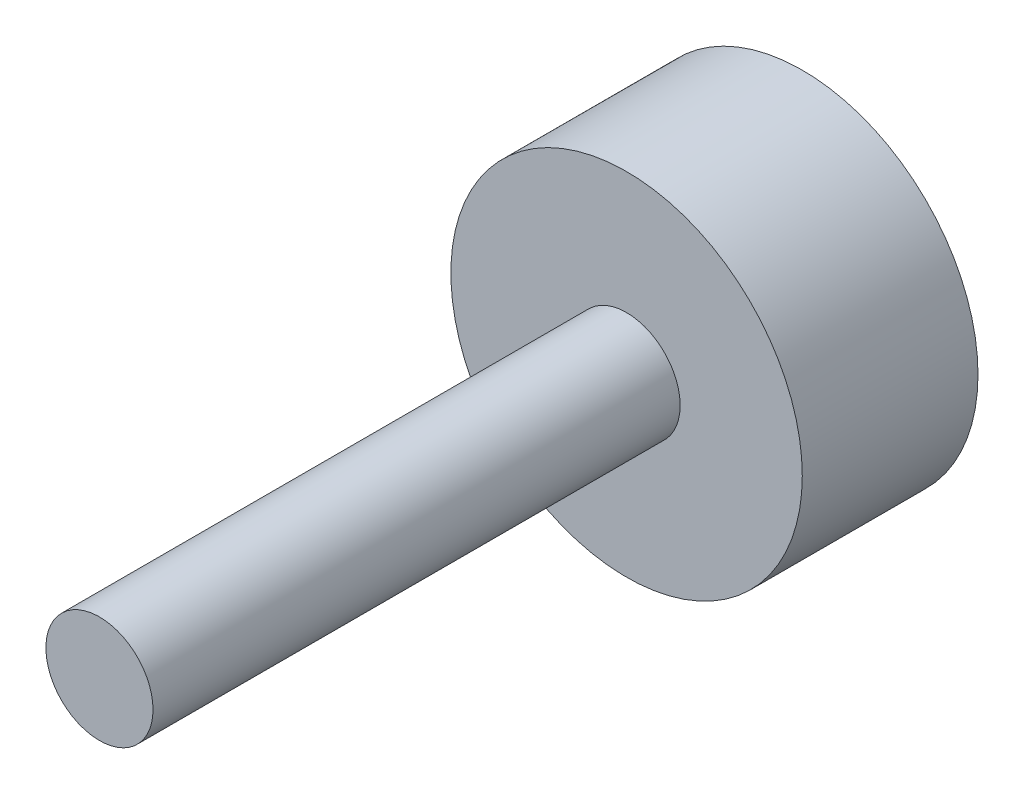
from build123d import *

# Parameters (mm, degrees)
SKETCH1_R           = 5
BOSS_EXTRUDE1_DEPTH = 5
SKETCH2_R           = 1.524
BOSS_EXTRUDE2_DEPTH = 15


with BuildPart() as part:
    # Sketch1 → Boss-Extrude1 (new body)
    with BuildSketch(Plane.XY):
        Circle(SKETCH1_R)
    extrude(amount=BOSS_EXTRUDE1_DEPTH)

    # Sketch2 → Boss-Extrude2 (add)
    with BuildSketch(Plane.XY.offset(5)):
        Circle(SKETCH2_R)
    extrude(amount=BOSS_EXTRUDE2_DEPTH)


solid = part.part
